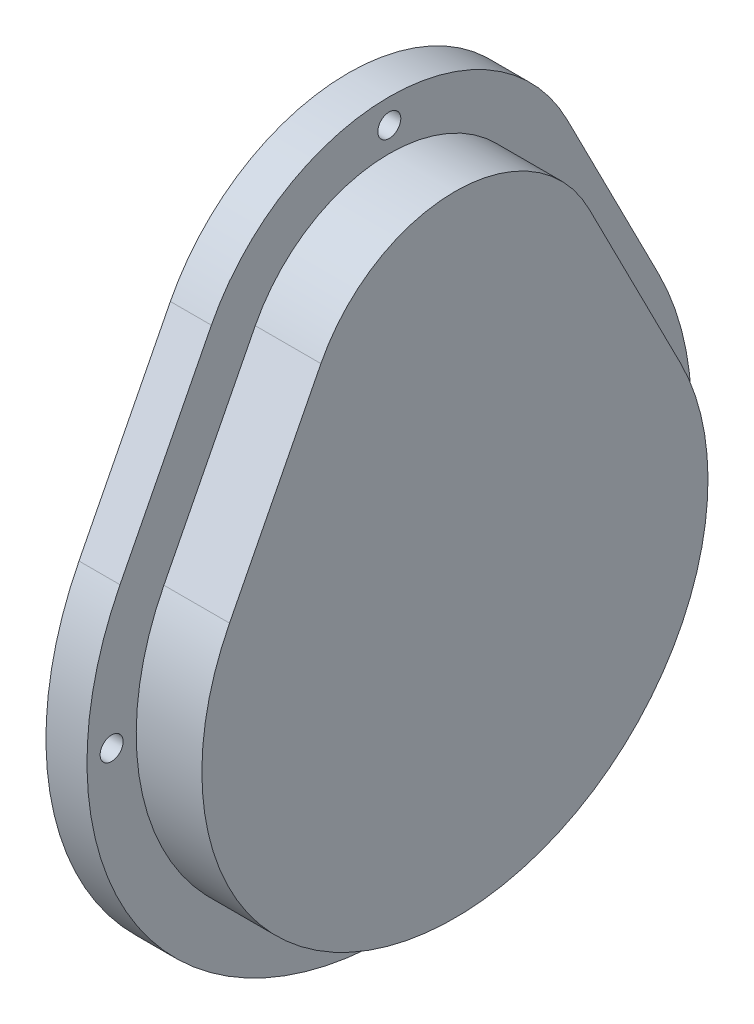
ISO-10303-21;
HEADER;
FILE_DESCRIPTION(('STEP AP214'),'2;1');
FILE_NAME('part.step','',(''),(''),'','','');
FILE_SCHEMA(('AUTOMOTIVE_DESIGN { 1 0 10303 214 1 1 1 1 }'));
ENDSEC;
DATA;
#1=APPLICATION_CONTEXT('core data for automotive mechanical design processes');
#2=APPLICATION_PROTOCOL_DEFINITION('international standard','automotive_design',2000,#1);
#3=PRODUCT_CONTEXT('',#1,'mechanical');
#4=PRODUCT('Part','Part','',(#3));
#5=PRODUCT_RELATED_PRODUCT_CATEGORY('part','',(#4));
#6=PRODUCT_DEFINITION_FORMATION('','',#4);
#7=PRODUCT_DEFINITION_CONTEXT('part definition',#1,'design');
#8=PRODUCT_DEFINITION('design','',#6,#7);
#9=PRODUCT_DEFINITION_SHAPE('','',#8);
#10=(LENGTH_UNIT() NAMED_UNIT(*) SI_UNIT(.MILLI.,.METRE.));
#11=(NAMED_UNIT(*) PLANE_ANGLE_UNIT() SI_UNIT($,.RADIAN.));
#12=(NAMED_UNIT(*) SI_UNIT($,.STERADIAN.) SOLID_ANGLE_UNIT());
#13=UNCERTAINTY_MEASURE_WITH_UNIT(LENGTH_MEASURE(1.E-05),#10,'distance_accuracy_value','');
#14=(GEOMETRIC_REPRESENTATION_CONTEXT(3) GLOBAL_UNCERTAINTY_ASSIGNED_CONTEXT((#13)) GLOBAL_UNIT_ASSIGNED_CONTEXT((#10,
#11,#12)) REPRESENTATION_CONTEXT('',''));
#15=CARTESIAN_POINT('',(0.,0.,0.));
#16=DIRECTION('',(0.,0.,1.));
#17=DIRECTION('',(1.,0.,0.));
#18=AXIS2_PLACEMENT_3D('',#15,#16,#17);
#19=CARTESIAN_POINT('',(-5.08,17.4625,0.));
#20=DIRECTION('',(1.,0.,0.));
#21=DIRECTION('',(0.,0.,-1.));
#22=AXIS2_PLACEMENT_3D('',#19,#20,#21);
#23=PLANE('',#22);
#24=CARTESIAN_POINT('',(-5.08,0.,0.));
#25=DIRECTION('',(1.,0.,0.));
#26=DIRECTION('',(0.,0.,-1.));
#27=AXIS2_PLACEMENT_3D('',#24,#25,#26);
#28=CIRCLE('',#27,16.40459);
#29=CARTESIAN_POINT('',(-5.08,7.45663181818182,14.6119545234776));
#30=VERTEX_POINT('',#29);
#31=CARTESIAN_POINT('',(-5.08,7.45663181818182,-14.6119545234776));
#32=VERTEX_POINT('',#31);
#33=EDGE_CURVE('E270',#30,#32,#28,.T.);
#34=ORIENTED_EDGE('',*,*,#33,.T.);
#35=DIRECTION('',(0.,0.890723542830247,0.454545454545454));
#36=VECTOR('',#35,1.);
#37=CARTESIAN_POINT('',(-5.08,7.45663181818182,-14.6119545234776));
#38=LINE('',#37,#36);
#39=CARTESIAN_POINT('',(-5.08,21.3111772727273,-7.54183640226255));
#40=VERTEX_POINT('',#39);
#41=EDGE_CURVE('E257',#32,#40,#38,.T.);
#42=ORIENTED_EDGE('',*,*,#41,.T.);
#43=CARTESIAN_POINT('',(-5.08,17.4625,0.));
#44=DIRECTION('',(1.,0.,0.));
#45=DIRECTION('',(0.,0.,-1.));
#46=AXIS2_PLACEMENT_3D('',#43,#44,#45);
#47=CIRCLE('',#46,8.46709);
#48=CARTESIAN_POINT('',(-5.08,21.3111772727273,7.54183640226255));
#49=VERTEX_POINT('',#48);
#50=EDGE_CURVE('E261',#40,#49,#47,.T.);
#51=ORIENTED_EDGE('',*,*,#50,.T.);
#52=DIRECTION('',(0.,0.890723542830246,-0.454545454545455));
#53=VECTOR('',#52,1.);
#54=CARTESIAN_POINT('',(-5.08,7.45663181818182,14.6119545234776));
#55=LINE('',#54,#53);
#56=EDGE_CURVE('E266',#30,#49,#55,.T.);
#57=ORIENTED_EDGE('',*,*,#56,.F.);
#58=EDGE_LOOP('',(#34,#42,#51,#57));
#59=FACE_BOUND('',#58,.T.);
#60=CARTESIAN_POINT('',(-5.08,0.,-21.48459));
#61=DIRECTION('',(-1.,0.,0.));
#62=DIRECTION('',(0.,0.,1.));
#63=AXIS2_PLACEMENT_3D('',#60,#61,#62);
#64=CIRCLE('',#63,0.889);
#65=CARTESIAN_POINT('',(-5.08,0.,-20.59559));
#66=VERTEX_POINT('',#65);
#67=EDGE_CURVE('E410',#66,#66,#64,.T.);
#68=ORIENTED_EDGE('',*,*,#67,.F.);
#69=EDGE_LOOP('',(#68));
#70=FACE_BOUND('',#69,.T.);
#71=CARTESIAN_POINT('',(-5.08,0.,21.48459));
#72=DIRECTION('',(-1.,0.,0.));
#73=DIRECTION('',(0.,0.,1.));
#74=AXIS2_PLACEMENT_3D('',#71,#72,#73);
#75=CIRCLE('',#74,0.889);
#76=CARTESIAN_POINT('',(-5.08,0.,22.37359));
#77=VERTEX_POINT('',#76);
#78=EDGE_CURVE('E179',#77,#77,#75,.T.);
#79=ORIENTED_EDGE('',*,*,#78,.F.);
#80=EDGE_LOOP('',(#79));
#81=FACE_BOUND('',#80,.T.);
#82=CARTESIAN_POINT('',(-5.08,-21.48459,0.));
#83=DIRECTION('',(-1.,0.,0.));
#84=DIRECTION('',(0.,0.,1.));
#85=AXIS2_PLACEMENT_3D('',#82,#83,#84);
#86=CIRCLE('',#85,0.889);
#87=CARTESIAN_POINT('',(-5.08,-21.48459,0.889));
#88=VERTEX_POINT('',#87);
#89=EDGE_CURVE('E193',#88,#88,#86,.T.);
#90=ORIENTED_EDGE('',*,*,#89,.F.);
#91=EDGE_LOOP('',(#90));
#92=FACE_BOUND('',#91,.T.);
#93=CARTESIAN_POINT('',(-5.08,31.00959,0.));
#94=DIRECTION('',(-1.,0.,0.));
#95=DIRECTION('',(0.,0.,1.));
#96=AXIS2_PLACEMENT_3D('',#93,#94,#95);
#97=CIRCLE('',#96,0.889);
#98=CARTESIAN_POINT('',(-5.08,31.00959,0.889));
#99=VERTEX_POINT('',#98);
#100=EDGE_CURVE('E201',#99,#99,#97,.T.);
#101=ORIENTED_EDGE('',*,*,#100,.F.);
#102=EDGE_LOOP('',(#101));
#103=FACE_BOUND('',#102,.T.);
#104=CARTESIAN_POINT('',(-5.08,17.4625,0.));
#105=DIRECTION('',(-1.,0.,0.));
#106=DIRECTION('',(0.,0.,1.));
#107=AXIS2_PLACEMENT_3D('',#104,#105,#106);
#108=CIRCLE('',#107,15.45209);
#109=CARTESIAN_POINT('',(-5.08,24.4861772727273,13.7635403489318));
#110=VERTEX_POINT('',#109);
#111=CARTESIAN_POINT('',(-5.08,24.4861772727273,-13.7635403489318));
#112=VERTEX_POINT('',#111);
#113=EDGE_CURVE('E209',#110,#112,#108,.T.);
#114=ORIENTED_EDGE('',*,*,#113,.T.);
#115=DIRECTION('',(0.,-0.890723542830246,-0.454545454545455));
#116=VECTOR('',#115,1.);
#117=CARTESIAN_POINT('',(-5.08,24.4861772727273,-13.7635403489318));
#118=LINE('',#117,#116);
#119=CARTESIAN_POINT('',(-5.08,10.6316318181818,-20.8336584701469));
#120=VERTEX_POINT('',#119);
#121=EDGE_CURVE('E234',#112,#120,#118,.T.);
#122=ORIENTED_EDGE('',*,*,#121,.T.);
#123=CARTESIAN_POINT('',(-5.08,0.,0.));
#124=DIRECTION('',(-1.,0.,0.));
#125=DIRECTION('',(0.,0.,1.));
#126=AXIS2_PLACEMENT_3D('',#123,#124,#125);
#127=CIRCLE('',#126,23.38959);
#128=CARTESIAN_POINT('',(-5.08,10.6316318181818,20.8336584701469));
#129=VERTEX_POINT('',#128);
#130=EDGE_CURVE('E238',#120,#129,#127,.T.);
#131=ORIENTED_EDGE('',*,*,#130,.T.);
#132=DIRECTION('',(0.,0.890723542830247,-0.454545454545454));
#133=VECTOR('',#132,1.);
#134=CARTESIAN_POINT('',(-5.08,10.6316318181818,20.8336584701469));
#135=LINE('',#134,#133);
#136=EDGE_CURVE('E218',#129,#110,#135,.T.);
#137=ORIENTED_EDGE('',*,*,#136,.T.);
#138=EDGE_LOOP('',(#114,#122,#131,#137));
#139=FACE_BOUND('',#138,.T.);
#140=ADVANCED_FACE('F71',(#59,#70,#81,#92,#103,#139),#23,.F.);
#141=CARTESIAN_POINT('',(-5.08,7.45663181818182,-14.6119545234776));
#142=DIRECTION('',(0.,0.454545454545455,-0.890723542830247));
#143=DIRECTION('',(0.,0.890723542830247,0.454545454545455));
#144=AXIS2_PLACEMENT_3D('',#141,#142,#143);
#145=PLANE('',#144);
#146=DIRECTION('',(0.,0.890723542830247,0.454545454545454));
#147=VECTOR('',#146,1.);
#148=CARTESIAN_POINT('',(0.,7.45663181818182,-14.6119545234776));
#149=LINE('',#148,#147);
#150=CARTESIAN_POINT('',(0.,7.45663181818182,-14.6119545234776));
#151=VERTEX_POINT('',#150);
#152=CARTESIAN_POINT('',(0.,21.3111772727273,-7.54183640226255));
#153=VERTEX_POINT('',#152);
#154=EDGE_CURVE('E248',#151,#153,#149,.T.);
#155=ORIENTED_EDGE('',*,*,#154,.T.);
#156=DIRECTION('',(1.,0.,0.));
#157=VECTOR('',#156,1.);
#158=CARTESIAN_POINT('',(-5.08,21.3111772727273,-7.54183640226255));
#159=LINE('',#158,#157);
#160=EDGE_CURVE('E274',#40,#153,#159,.T.);
#161=ORIENTED_EDGE('',*,*,#160,.F.);
#162=ORIENTED_EDGE('',*,*,#41,.F.);
#163=DIRECTION('',(1.,0.,0.));
#164=VECTOR('',#163,1.);
#165=CARTESIAN_POINT('',(-5.08,7.45663181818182,-14.6119545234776));
#166=LINE('',#165,#164);
#167=EDGE_CURVE('E288',#32,#151,#166,.T.);
#168=ORIENTED_EDGE('',*,*,#167,.T.);
#169=EDGE_LOOP('',(#155,#161,#162,#168));
#170=FACE_BOUND('',#169,.T.);
#171=ADVANCED_FACE('F331',(#170),#145,.F.);
#172=CARTESIAN_POINT('',(-5.08,0.,0.));
#173=DIRECTION('',(1.,0.,0.));
#174=DIRECTION('',(0.,0.,-1.));
#175=AXIS2_PLACEMENT_3D('',#172,#173,#174);
#176=CYLINDRICAL_SURFACE('',#175,16.40459);
#177=CARTESIAN_POINT('',(0.,0.,0.));
#178=DIRECTION('',(1.,0.,0.));
#179=DIRECTION('',(0.,0.,-1.));
#180=AXIS2_PLACEMENT_3D('',#177,#178,#179);
#181=CIRCLE('',#180,16.40459);
#182=CARTESIAN_POINT('',(0.,7.45663181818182,14.6119545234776));
#183=VERTEX_POINT('',#182);
#184=EDGE_CURVE('E262',#183,#151,#181,.T.);
#185=ORIENTED_EDGE('',*,*,#184,.T.);
#186=ORIENTED_EDGE('',*,*,#167,.F.);
#187=ORIENTED_EDGE('',*,*,#33,.F.);
#188=DIRECTION('',(1.,0.,0.));
#189=VECTOR('',#188,1.);
#190=CARTESIAN_POINT('',(-5.08,7.45663181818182,14.6119545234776));
#191=LINE('',#190,#189);
#192=EDGE_CURVE('E293',#30,#183,#191,.T.);
#193=ORIENTED_EDGE('',*,*,#192,.T.);
#194=EDGE_LOOP('',(#185,#186,#187,#193));
#195=FACE_BOUND('',#194,.T.);
#196=ADVANCED_FACE('F339',(#195),#176,.F.);
#197=CARTESIAN_POINT('',(-5.08,7.45663181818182,14.6119545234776));
#198=DIRECTION('',(0.,-0.454545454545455,-0.890723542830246));
#199=DIRECTION('',(0.,0.890723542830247,-0.454545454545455));
#200=AXIS2_PLACEMENT_3D('',#197,#198,#199);
#201=PLANE('',#200);
#202=DIRECTION('',(0.,0.890723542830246,-0.454545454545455));
#203=VECTOR('',#202,1.);
#204=CARTESIAN_POINT('',(0.,7.45663181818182,14.6119545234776));
#205=LINE('',#204,#203);
#206=CARTESIAN_POINT('',(0.,21.3111772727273,7.54183640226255));
#207=VERTEX_POINT('',#206);
#208=EDGE_CURVE('E282',#183,#207,#205,.T.);
#209=ORIENTED_EDGE('',*,*,#208,.F.);
#210=ORIENTED_EDGE('',*,*,#192,.F.);
#211=ORIENTED_EDGE('',*,*,#56,.T.);
#212=DIRECTION('',(1.,0.,0.));
#213=VECTOR('',#212,1.);
#214=CARTESIAN_POINT('',(-5.08,21.3111772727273,7.54183640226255));
#215=LINE('',#214,#213);
#216=EDGE_CURVE('E297',#49,#207,#215,.T.);
#217=ORIENTED_EDGE('',*,*,#216,.T.);
#218=EDGE_LOOP('',(#209,#210,#211,#217));
#219=FACE_BOUND('',#218,.T.);
#220=ADVANCED_FACE('F357',(#219),#201,.T.);
#221=CARTESIAN_POINT('',(-5.08,17.4625,0.));
#222=DIRECTION('',(1.,0.,0.));
#223=DIRECTION('',(0.,0.,-1.));
#224=AXIS2_PLACEMENT_3D('',#221,#222,#223);
#225=CYLINDRICAL_SURFACE('',#224,8.46709);
#226=CARTESIAN_POINT('',(0.,17.4625,0.));
#227=DIRECTION('',(1.,0.,0.));
#228=DIRECTION('',(0.,0.,-1.));
#229=AXIS2_PLACEMENT_3D('',#226,#227,#228);
#230=CIRCLE('',#229,8.46709);
#231=EDGE_CURVE('E278',#153,#207,#230,.T.);
#232=ORIENTED_EDGE('',*,*,#231,.T.);
#233=ORIENTED_EDGE('',*,*,#216,.F.);
#234=ORIENTED_EDGE('',*,*,#50,.F.);
#235=ORIENTED_EDGE('',*,*,#160,.T.);
#236=EDGE_LOOP('',(#232,#233,#234,#235));
#237=FACE_BOUND('',#236,.T.);
#238=ADVANCED_FACE('F349',(#237),#225,.F.);
#239=CARTESIAN_POINT('',(0.,17.4625,0.));
#240=DIRECTION('',(1.,0.,0.));
#241=DIRECTION('',(0.,0.,-1.));
#242=AXIS2_PLACEMENT_3D('',#239,#240,#241);
#243=PLANE('',#242);
#244=ORIENTED_EDGE('',*,*,#154,.F.);
#245=ORIENTED_EDGE('',*,*,#184,.F.);
#246=ORIENTED_EDGE('',*,*,#208,.T.);
#247=ORIENTED_EDGE('',*,*,#231,.F.);
#248=EDGE_LOOP('',(#244,#245,#246,#247));
#249=FACE_BOUND('',#248,.T.);
#250=ADVANCED_FACE('F347',(#249),#243,.F.);
#251=CARTESIAN_POINT('',(-1.905,17.4625,0.));
#252=DIRECTION('',(-1.,0.,0.));
#253=DIRECTION('',(0.,0.,1.));
#254=AXIS2_PLACEMENT_3D('',#251,#252,#253);
#255=CYLINDRICAL_SURFACE('',#254,15.45209);
#256=ORIENTED_EDGE('',*,*,#113,.F.);
#257=DIRECTION('',(-1.,0.,0.));
#258=VECTOR('',#257,1.);
#259=CARTESIAN_POINT('',(-1.905,24.4861772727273,13.7635403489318));
#260=LINE('',#259,#258);
#261=CARTESIAN_POINT('',(-1.905,24.4861772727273,13.7635403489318));
#262=VERTEX_POINT('',#261);
#263=EDGE_CURVE('E245',#262,#110,#260,.T.);
#264=ORIENTED_EDGE('',*,*,#263,.F.);
#265=CARTESIAN_POINT('',(-1.905,17.4625,0.));
#266=DIRECTION('',(-1.,0.,0.));
#267=DIRECTION('',(0.,0.,1.));
#268=AXIS2_PLACEMENT_3D('',#265,#266,#267);
#269=CIRCLE('',#268,15.45209);
#270=CARTESIAN_POINT('',(-1.905,24.4861772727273,-13.7635403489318));
#271=VERTEX_POINT('',#270);
#272=EDGE_CURVE('E213',#262,#271,#269,.T.);
#273=ORIENTED_EDGE('',*,*,#272,.T.);
#274=DIRECTION('',(-1.,0.,0.));
#275=VECTOR('',#274,1.);
#276=CARTESIAN_POINT('',(-1.905,24.4861772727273,-13.7635403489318));
#277=LINE('',#276,#275);
#278=EDGE_CURVE('E230',#271,#112,#277,.T.);
#279=ORIENTED_EDGE('',*,*,#278,.T.);
#280=EDGE_LOOP('',(#256,#264,#273,#279));
#281=FACE_BOUND('',#280,.T.);
#282=ADVANCED_FACE('F348',(#281),#255,.T.);
#283=CARTESIAN_POINT('',(-1.905,10.6316318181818,20.8336584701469));
#284=DIRECTION('',(0.,0.454545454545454,0.890723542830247));
#285=DIRECTION('',(0.,-0.890723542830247,0.454545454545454));
#286=AXIS2_PLACEMENT_3D('',#283,#284,#285);
#287=PLANE('',#286);
#288=ORIENTED_EDGE('',*,*,#136,.F.);
#289=DIRECTION('',(-1.,0.,0.));
#290=VECTOR('',#289,1.);
#291=CARTESIAN_POINT('',(-1.905,10.6316318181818,20.8336584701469));
#292=LINE('',#291,#290);
#293=CARTESIAN_POINT('',(-1.905,10.6316318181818,20.8336584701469));
#294=VERTEX_POINT('',#293);
#295=EDGE_CURVE('E249',#294,#129,#292,.T.);
#296=ORIENTED_EDGE('',*,*,#295,.F.);
#297=DIRECTION('',(0.,0.890723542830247,-0.454545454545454));
#298=VECTOR('',#297,1.);
#299=CARTESIAN_POINT('',(-1.905,10.6316318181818,20.8336584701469));
#300=LINE('',#299,#298);
#301=EDGE_CURVE('E226',#294,#262,#300,.T.);
#302=ORIENTED_EDGE('',*,*,#301,.T.);
#303=ORIENTED_EDGE('',*,*,#263,.T.);
#304=EDGE_LOOP('',(#288,#296,#302,#303));
#305=FACE_BOUND('',#304,.T.);
#306=ADVANCED_FACE('F354',(#305),#287,.T.);
#307=CARTESIAN_POINT('',(-1.905,0.,0.));
#308=DIRECTION('',(-1.,0.,0.));
#309=DIRECTION('',(0.,0.,1.));
#310=AXIS2_PLACEMENT_3D('',#307,#308,#309);
#311=CYLINDRICAL_SURFACE('',#310,23.38959);
#312=ORIENTED_EDGE('',*,*,#130,.F.);
#313=DIRECTION('',(-1.,0.,0.));
#314=VECTOR('',#313,1.);
#315=CARTESIAN_POINT('',(-1.905,10.6316318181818,-20.8336584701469));
#316=LINE('',#315,#314);
#317=CARTESIAN_POINT('',(-1.905,10.6316318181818,-20.8336584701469));
#318=VERTEX_POINT('',#317);
#319=EDGE_CURVE('E252',#318,#120,#316,.T.);
#320=ORIENTED_EDGE('',*,*,#319,.F.);
#321=CARTESIAN_POINT('',(-1.905,0.,0.));
#322=DIRECTION('',(-1.,0.,0.));
#323=DIRECTION('',(0.,0.,1.));
#324=AXIS2_PLACEMENT_3D('',#321,#322,#323);
#325=CIRCLE('',#324,23.38959);
#326=EDGE_CURVE('E222',#318,#294,#325,.T.);
#327=ORIENTED_EDGE('',*,*,#326,.T.);
#328=ORIENTED_EDGE('',*,*,#295,.T.);
#329=EDGE_LOOP('',(#312,#320,#327,#328));
#330=FACE_BOUND('',#329,.T.);
#331=ADVANCED_FACE('F376',(#330),#311,.T.);
#332=CARTESIAN_POINT('',(-1.905,24.4861772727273,-13.7635403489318));
#333=DIRECTION('',(0.,0.454545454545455,-0.890723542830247));
#334=DIRECTION('',(0.,0.890723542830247,0.454545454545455));
#335=AXIS2_PLACEMENT_3D('',#332,#333,#334);
#336=PLANE('',#335);
#337=ORIENTED_EDGE('',*,*,#121,.F.);
#338=ORIENTED_EDGE('',*,*,#278,.F.);
#339=DIRECTION('',(0.,-0.890723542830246,-0.454545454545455));
#340=VECTOR('',#339,1.);
#341=CARTESIAN_POINT('',(-1.905,24.4861772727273,-13.7635403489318));
#342=LINE('',#341,#340);
#343=EDGE_CURVE('E217',#271,#318,#342,.T.);
#344=ORIENTED_EDGE('',*,*,#343,.T.);
#345=ORIENTED_EDGE('',*,*,#319,.T.);
#346=EDGE_LOOP('',(#337,#338,#344,#345));
#347=FACE_BOUND('',#346,.T.);
#348=ADVANCED_FACE('F373',(#347),#336,.T.);
#349=CARTESIAN_POINT('',(-1.905,17.4625,0.));
#350=DIRECTION('',(-1.,0.,0.));
#351=DIRECTION('',(0.,0.,1.));
#352=AXIS2_PLACEMENT_3D('',#349,#350,#351);
#353=PLANE('',#352);
#354=CARTESIAN_POINT('',(-1.905,0.,-21.48459));
#355=DIRECTION('',(-1.,0.,0.));
#356=DIRECTION('',(0.,0.,1.));
#357=AXIS2_PLACEMENT_3D('',#354,#355,#356);
#358=CIRCLE('',#357,0.889);
#359=CARTESIAN_POINT('',(-1.905,0.,-20.59559));
#360=VERTEX_POINT('',#359);
#361=EDGE_CURVE('E407',#360,#360,#358,.T.);
#362=ORIENTED_EDGE('',*,*,#361,.T.);
#363=EDGE_LOOP('',(#362));
#364=FACE_BOUND('',#363,.T.);
#365=DIRECTION('',(0.,-0.890723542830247,-0.454545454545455));
#366=VECTOR('',#365,1.);
#367=CARTESIAN_POINT('',(-1.905,8.89981363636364,-17.4400017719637));
#368=LINE('',#367,#366);
#369=CARTESIAN_POINT('',(-1.905,22.7543590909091,-10.3698836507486));
#370=VERTEX_POINT('',#369);
#371=CARTESIAN_POINT('',(-1.905,8.89981363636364,-17.4400017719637));
#372=VERTEX_POINT('',#371);
#373=EDGE_CURVE('E175',#370,#372,#368,.T.);
#374=ORIENTED_EDGE('',*,*,#373,.T.);
#375=CARTESIAN_POINT('',(-1.905,0.,0.));
#376=DIRECTION('',(-1.,0.,0.));
#377=DIRECTION('',(0.,0.,1.));
#378=AXIS2_PLACEMENT_3D('',#375,#376,#377);
#379=CIRCLE('',#378,19.57959);
#380=CARTESIAN_POINT('',(-1.905,8.89981363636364,17.4400017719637));
#381=VERTEX_POINT('',#380);
#382=EDGE_CURVE('E95',#372,#381,#379,.T.);
#383=ORIENTED_EDGE('',*,*,#382,.T.);
#384=DIRECTION('',(0.,0.890723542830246,-0.454545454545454));
#385=VECTOR('',#384,1.);
#386=CARTESIAN_POINT('',(-1.905,8.89981363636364,17.4400017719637));
#387=LINE('',#386,#385);
#388=CARTESIAN_POINT('',(-1.905,22.7543590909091,10.3698836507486));
#389=VERTEX_POINT('',#388);
#390=EDGE_CURVE('E89',#381,#389,#387,.T.);
#391=ORIENTED_EDGE('',*,*,#390,.T.);
#392=CARTESIAN_POINT('',(-1.905,17.4625,0.));
#393=DIRECTION('',(-1.,0.,0.));
#394=DIRECTION('',(0.,0.,1.));
#395=AXIS2_PLACEMENT_3D('',#392,#393,#394);
#396=CIRCLE('',#395,11.64209);
#397=EDGE_CURVE('E169',#389,#370,#396,.T.);
#398=ORIENTED_EDGE('',*,*,#397,.T.);
#399=EDGE_LOOP('',(#374,#383,#391,#398));
#400=FACE_BOUND('',#399,.T.);
#401=CARTESIAN_POINT('',(-1.905,0.,21.48459));
#402=DIRECTION('',(-1.,0.,0.));
#403=DIRECTION('',(0.,0.,1.));
#404=AXIS2_PLACEMENT_3D('',#401,#402,#403);
#405=CIRCLE('',#404,0.889);
#406=CARTESIAN_POINT('',(-1.905,0.,22.37359));
#407=VERTEX_POINT('',#406);
#408=EDGE_CURVE('E189',#407,#407,#405,.T.);
#409=ORIENTED_EDGE('',*,*,#408,.T.);
#410=EDGE_LOOP('',(#409));
#411=FACE_BOUND('',#410,.T.);
#412=CARTESIAN_POINT('',(-1.905,-21.48459,0.));
#413=DIRECTION('',(-1.,0.,0.));
#414=DIRECTION('',(0.,0.,1.));
#415=AXIS2_PLACEMENT_3D('',#412,#413,#414);
#416=CIRCLE('',#415,0.889);
#417=CARTESIAN_POINT('',(-1.905,-21.48459,0.889));
#418=VERTEX_POINT('',#417);
#419=EDGE_CURVE('E197',#418,#418,#416,.T.);
#420=ORIENTED_EDGE('',*,*,#419,.T.);
#421=EDGE_LOOP('',(#420));
#422=FACE_BOUND('',#421,.T.);
#423=CARTESIAN_POINT('',(-1.905,31.00959,0.));
#424=DIRECTION('',(-1.,0.,0.));
#425=DIRECTION('',(0.,0.,1.));
#426=AXIS2_PLACEMENT_3D('',#423,#424,#425);
#427=CIRCLE('',#426,0.889);
#428=CARTESIAN_POINT('',(-1.905,31.00959,0.889));
#429=VERTEX_POINT('',#428);
#430=EDGE_CURVE('E205',#429,#429,#427,.T.);
#431=ORIENTED_EDGE('',*,*,#430,.T.);
#432=EDGE_LOOP('',(#431));
#433=FACE_BOUND('',#432,.T.);
#434=ORIENTED_EDGE('',*,*,#272,.F.);
#435=ORIENTED_EDGE('',*,*,#301,.F.);
#436=ORIENTED_EDGE('',*,*,#326,.F.);
#437=ORIENTED_EDGE('',*,*,#343,.F.);
#438=EDGE_LOOP('',(#434,#435,#436,#437));
#439=FACE_BOUND('',#438,.T.);
#440=ADVANCED_FACE('F181',(#364,#400,#411,#422,#433,#439),#353,.F.);
#441=CARTESIAN_POINT('',(-1.905,31.00959,0.));
#442=DIRECTION('',(-1.,0.,0.));
#443=DIRECTION('',(0.,0.,1.));
#444=AXIS2_PLACEMENT_3D('',#441,#442,#443);
#445=CYLINDRICAL_SURFACE('',#444,0.889);
#446=ORIENTED_EDGE('',*,*,#430,.F.);
#447=EDGE_LOOP('',(#446));
#448=FACE_BOUND('',#447,.T.);
#449=ORIENTED_EDGE('',*,*,#100,.T.);
#450=EDGE_LOOP('',(#449));
#451=FACE_BOUND('',#450,.T.);
#452=ADVANCED_FACE('F386',(#448,#451),#445,.F.);
#453=CARTESIAN_POINT('',(-1.905,-21.48459,0.));
#454=DIRECTION('',(-1.,0.,0.));
#455=DIRECTION('',(0.,0.,1.));
#456=AXIS2_PLACEMENT_3D('',#453,#454,#455);
#457=CYLINDRICAL_SURFACE('',#456,0.889);
#458=ORIENTED_EDGE('',*,*,#419,.F.);
#459=EDGE_LOOP('',(#458));
#460=FACE_BOUND('',#459,.T.);
#461=ORIENTED_EDGE('',*,*,#89,.T.);
#462=EDGE_LOOP('',(#461));
#463=FACE_BOUND('',#462,.T.);
#464=ADVANCED_FACE('F390',(#460,#463),#457,.F.);
#465=CARTESIAN_POINT('',(-1.905,0.,21.48459));
#466=DIRECTION('',(-1.,0.,0.));
#467=DIRECTION('',(0.,0.,1.));
#468=AXIS2_PLACEMENT_3D('',#465,#466,#467);
#469=CYLINDRICAL_SURFACE('',#468,0.889);
#470=ORIENTED_EDGE('',*,*,#408,.F.);
#471=EDGE_LOOP('',(#470));
#472=FACE_BOUND('',#471,.T.);
#473=ORIENTED_EDGE('',*,*,#78,.T.);
#474=EDGE_LOOP('',(#473));
#475=FACE_BOUND('',#474,.T.);
#476=ADVANCED_FACE('F394',(#472,#475),#469,.F.);
#477=CARTESIAN_POINT('',(-1.905,0.,-21.48459));
#478=DIRECTION('',(-1.,0.,0.));
#479=DIRECTION('',(0.,0.,1.));
#480=AXIS2_PLACEMENT_3D('',#477,#478,#479);
#481=CYLINDRICAL_SURFACE('',#480,0.889);
#482=ORIENTED_EDGE('',*,*,#361,.F.);
#483=EDGE_LOOP('',(#482));
#484=FACE_BOUND('',#483,.T.);
#485=ORIENTED_EDGE('',*,*,#67,.T.);
#486=EDGE_LOOP('',(#485));
#487=FACE_BOUND('',#486,.T.);
#488=ADVANCED_FACE('F346',(#484,#487),#481,.F.);
#489=CARTESIAN_POINT('',(3.175,17.4625,0.));
#490=DIRECTION('',(1.,0.,0.));
#491=DIRECTION('',(0.,0.,-1.));
#492=AXIS2_PLACEMENT_3D('',#489,#490,#491);
#493=PLANE('',#492);
#494=DIRECTION('',(0.,0.890723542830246,-0.454545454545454));
#495=VECTOR('',#494,1.);
#496=CARTESIAN_POINT('',(3.175,8.89981363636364,17.4400017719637));
#497=LINE('',#496,#495);
#498=CARTESIAN_POINT('',(3.175,8.89981363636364,17.4400017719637));
#499=VERTEX_POINT('',#498);
#500=CARTESIAN_POINT('',(3.175,22.7543590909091,10.3698836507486));
#501=VERTEX_POINT('',#500);
#502=EDGE_CURVE('E292',#499,#501,#497,.T.);
#503=ORIENTED_EDGE('',*,*,#502,.F.);
#504=CARTESIAN_POINT('',(3.175,0.,0.));
#505=DIRECTION('',(1.,0.,0.));
#506=DIRECTION('',(0.,0.,-1.));
#507=AXIS2_PLACEMENT_3D('',#504,#505,#506);
#508=CIRCLE('',#507,19.57959);
#509=CARTESIAN_POINT('',(3.175,8.89981363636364,-17.4400017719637));
#510=VERTEX_POINT('',#509);
#511=EDGE_CURVE('E312',#499,#510,#508,.T.);
#512=ORIENTED_EDGE('',*,*,#511,.T.);
#513=DIRECTION('',(0.,0.890723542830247,0.454545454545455));
#514=VECTOR('',#513,1.);
#515=CARTESIAN_POINT('',(3.175,8.89981363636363,-17.4400017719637));
#516=LINE('',#515,#514);
#517=CARTESIAN_POINT('',(3.175,22.7543590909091,-10.3698836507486));
#518=VERTEX_POINT('',#517);
#519=EDGE_CURVE('E309',#510,#518,#516,.T.);
#520=ORIENTED_EDGE('',*,*,#519,.T.);
#521=CARTESIAN_POINT('',(3.175,17.4625,0.));
#522=DIRECTION('',(1.,0.,0.));
#523=DIRECTION('',(0.,0.,-1.));
#524=AXIS2_PLACEMENT_3D('',#521,#522,#523);
#525=CIRCLE('',#524,11.64209);
#526=EDGE_CURVE('E170',#518,#501,#525,.T.);
#527=ORIENTED_EDGE('',*,*,#526,.T.);
#528=EDGE_LOOP('',(#503,#512,#520,#527));
#529=FACE_BOUND('',#528,.T.);
#530=ADVANCED_FACE('F320',(#529),#493,.T.);
#531=CARTESIAN_POINT('',(3.175,17.4625,0.));
#532=DIRECTION('',(-1.,0.,0.));
#533=DIRECTION('',(0.,0.,1.));
#534=AXIS2_PLACEMENT_3D('',#531,#532,#533);
#535=CYLINDRICAL_SURFACE('',#534,11.64209);
#536=ORIENTED_EDGE('',*,*,#397,.F.);
#537=DIRECTION('',(-1.,0.,0.));
#538=VECTOR('',#537,1.);
#539=CARTESIAN_POINT('',(3.175,22.7543590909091,10.3698836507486));
#540=LINE('',#539,#538);
#541=EDGE_CURVE('E75',#501,#389,#540,.T.);
#542=ORIENTED_EDGE('',*,*,#541,.F.);
#543=ORIENTED_EDGE('',*,*,#526,.F.);
#544=DIRECTION('',(-1.,0.,0.));
#545=VECTOR('',#544,1.);
#546=CARTESIAN_POINT('',(3.175,22.7543590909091,-10.3698836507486));
#547=LINE('',#546,#545);
#548=EDGE_CURVE('E164',#518,#370,#547,.T.);
#549=ORIENTED_EDGE('',*,*,#548,.T.);
#550=EDGE_LOOP('',(#536,#542,#543,#549));
#551=FACE_BOUND('',#550,.T.);
#552=ADVANCED_FACE('F166',(#551),#535,.T.);
#553=CARTESIAN_POINT('',(3.175,8.89981363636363,-17.4400017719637));
#554=DIRECTION('',(0.,-0.454545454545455,0.890723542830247));
#555=DIRECTION('',(0.,-0.890723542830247,-0.454545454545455));
#556=AXIS2_PLACEMENT_3D('',#553,#554,#555);
#557=PLANE('',#556);
#558=ORIENTED_EDGE('',*,*,#373,.F.);
#559=ORIENTED_EDGE('',*,*,#548,.F.);
#560=ORIENTED_EDGE('',*,*,#519,.F.);
#561=DIRECTION('',(-1.,0.,0.));
#562=VECTOR('',#561,1.);
#563=CARTESIAN_POINT('',(3.175,8.89981363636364,-17.4400017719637));
#564=LINE('',#563,#562);
#565=EDGE_CURVE('E81',#510,#372,#564,.T.);
#566=ORIENTED_EDGE('',*,*,#565,.T.);
#567=EDGE_LOOP('',(#558,#559,#560,#566));
#568=FACE_BOUND('',#567,.T.);
#569=ADVANCED_FACE('F176',(#568),#557,.F.);
#570=CARTESIAN_POINT('',(3.175,0.,0.));
#571=DIRECTION('',(-1.,0.,0.));
#572=DIRECTION('',(0.,0.,1.));
#573=AXIS2_PLACEMENT_3D('',#570,#571,#572);
#574=CYLINDRICAL_SURFACE('',#573,19.57959);
#575=ORIENTED_EDGE('',*,*,#382,.F.);
#576=ORIENTED_EDGE('',*,*,#565,.F.);
#577=ORIENTED_EDGE('',*,*,#511,.F.);
#578=DIRECTION('',(-1.,0.,0.));
#579=VECTOR('',#578,1.);
#580=CARTESIAN_POINT('',(3.175,8.89981363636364,17.4400017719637));
#581=LINE('',#580,#579);
#582=EDGE_CURVE('E12',#499,#381,#581,.T.);
#583=ORIENTED_EDGE('',*,*,#582,.T.);
#584=EDGE_LOOP('',(#575,#576,#577,#583));
#585=FACE_BOUND('',#584,.T.);
#586=ADVANCED_FACE('F321',(#585),#574,.T.);
#587=CARTESIAN_POINT('',(3.175,8.89981363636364,17.4400017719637));
#588=DIRECTION('',(0.,0.454545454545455,0.890723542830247));
#589=DIRECTION('',(0.,-0.890723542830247,0.454545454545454));
#590=AXIS2_PLACEMENT_3D('',#587,#588,#589);
#591=PLANE('',#590);
#592=ORIENTED_EDGE('',*,*,#541,.T.);
#593=ORIENTED_EDGE('',*,*,#390,.F.);
#594=ORIENTED_EDGE('',*,*,#582,.F.);
#595=ORIENTED_EDGE('',*,*,#502,.T.);
#596=EDGE_LOOP('',(#592,#593,#594,#595));
#597=FACE_BOUND('',#596,.T.);
#598=ADVANCED_FACE('F73',(#597),#591,.T.);
#599=CLOSED_SHELL('',(#140,#171,#196,#220,#238,#250,#282,#306,#331,#348,#440,#452,#464,#476,
#488,#530,#552,#569,#586,#598));
#600=MANIFOLD_SOLID_BREP('B2',#599);
#601=ADVANCED_BREP_SHAPE_REPRESENTATION('',(#18,#600),#14);
#602=SHAPE_DEFINITION_REPRESENTATION(#9,#601);
ENDSEC;
END-ISO-10303-21;
